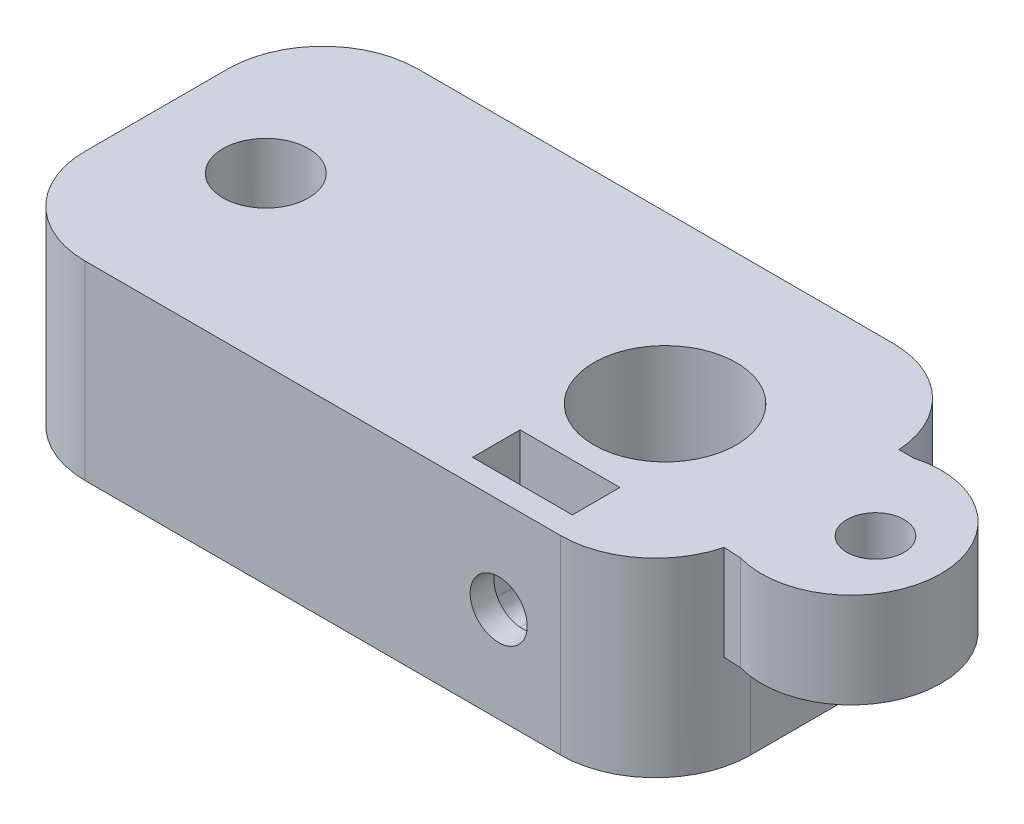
ISO-10303-21;
HEADER;
FILE_DESCRIPTION(('STEP AP214'),'2;1');
FILE_NAME('part.step','',(''),(''),'','','');
FILE_SCHEMA(('AUTOMOTIVE_DESIGN { 1 0 10303 214 1 1 1 1 }'));
ENDSEC;
DATA;
#1=APPLICATION_CONTEXT('core data for automotive mechanical design processes');
#2=APPLICATION_PROTOCOL_DEFINITION('international standard','automotive_design',2000,#1);
#3=PRODUCT_CONTEXT('',#1,'mechanical');
#4=PRODUCT('Part','Part','',(#3));
#5=PRODUCT_RELATED_PRODUCT_CATEGORY('part','',(#4));
#6=PRODUCT_DEFINITION_FORMATION('','',#4);
#7=PRODUCT_DEFINITION_CONTEXT('part definition',#1,'design');
#8=PRODUCT_DEFINITION('design','',#6,#7);
#9=PRODUCT_DEFINITION_SHAPE('','',#8);
#10=(LENGTH_UNIT() NAMED_UNIT(*) SI_UNIT(.MILLI.,.METRE.));
#11=(NAMED_UNIT(*) PLANE_ANGLE_UNIT() SI_UNIT($,.RADIAN.));
#12=(NAMED_UNIT(*) SI_UNIT($,.STERADIAN.) SOLID_ANGLE_UNIT());
#13=UNCERTAINTY_MEASURE_WITH_UNIT(LENGTH_MEASURE(1.E-05),#10,'distance_accuracy_value','');
#14=(GEOMETRIC_REPRESENTATION_CONTEXT(3) GLOBAL_UNCERTAINTY_ASSIGNED_CONTEXT((#13)) GLOBAL_UNIT_ASSIGNED_CONTEXT((#10,
#11,#12)) REPRESENTATION_CONTEXT('',''));
#15=CARTESIAN_POINT('',(0.,0.,0.));
#16=DIRECTION('',(0.,0.,1.));
#17=DIRECTION('',(1.,0.,0.));
#18=AXIS2_PLACEMENT_3D('',#15,#16,#17);
#19=CARTESIAN_POINT('',(-29.3853372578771,20.,-30.4999999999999));
#20=DIRECTION('',(-1.,0.,0.));
#21=DIRECTION('',(0.,0.,1.));
#22=AXIS2_PLACEMENT_3D('',#19,#20,#21);
#23=PLANE('',#22);
#24=DIRECTION('',(0.,0.,1.));
#25=VECTOR('',#24,1.);
#26=CARTESIAN_POINT('',(-29.3853372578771,10.,-40.4999999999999));
#27=LINE('',#26,#25);
#28=CARTESIAN_POINT('',(-29.3853372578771,10.,-55.4999999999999));
#29=VERTEX_POINT('',#28);
#30=CARTESIAN_POINT('',(-29.3853372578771,10.,-40.4999999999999));
#31=VERTEX_POINT('',#30);
#32=EDGE_CURVE('E228',#29,#31,#27,.T.);
#33=ORIENTED_EDGE('',*,*,#32,.T.);
#34=DIRECTION('',(0.,-1.,0.));
#35=VECTOR('',#34,1.);
#36=CARTESIAN_POINT('',(-29.3853372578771,20.,-40.4999999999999));
#37=LINE('',#36,#35);
#38=CARTESIAN_POINT('',(-29.3853372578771,0.,-40.4999999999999));
#39=VERTEX_POINT('',#38);
#40=EDGE_CURVE('E402',#31,#39,#37,.T.);
#41=ORIENTED_EDGE('',*,*,#40,.T.);
#42=DIRECTION('',(0.,0.,-1.));
#43=VECTOR('',#42,1.);
#44=CARTESIAN_POINT('',(-29.3853372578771,0.,-30.4999999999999));
#45=LINE('',#44,#43);
#46=CARTESIAN_POINT('',(-29.3853372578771,0.,-55.4999999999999));
#47=VERTEX_POINT('',#46);
#48=EDGE_CURVE('E432',#39,#47,#45,.T.);
#49=ORIENTED_EDGE('',*,*,#48,.T.);
#50=DIRECTION('',(0.,-1.,0.));
#51=VECTOR('',#50,1.);
#52=CARTESIAN_POINT('',(-29.3853372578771,20.,-55.4999999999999));
#53=LINE('',#52,#51);
#54=EDGE_CURVE('E399',#47,#29,#53,.F.);
#55=ORIENTED_EDGE('',*,*,#54,.T.);
#56=EDGE_LOOP('',(#33,#41,#49,#55));
#57=FACE_BOUND('',#56,.T.);
#58=ADVANCED_FACE('F33',(#57),#23,.F.);
#59=CARTESIAN_POINT('',(-45.8853372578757,10.,-65.5009999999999));
#60=DIRECTION('',(0.,0.,1.));
#61=DIRECTION('',(1.,0.,0.));
#62=AXIS2_PLACEMENT_3D('',#59,#60,#61);
#63=CYLINDRICAL_SURFACE('',#62,3.);
#64=CARTESIAN_POINT('',(-45.8853372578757,10.,-37.9999999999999));
#65=DIRECTION('',(0.,0.,-1.));
#66=DIRECTION('',(-1.,0.,0.));
#67=AXIS2_PLACEMENT_3D('',#64,#65,#66);
#68=CIRCLE('',#67,3.);
#69=CARTESIAN_POINT('',(-48.8853372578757,10.,-37.9999999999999));
#70=VERTEX_POINT('',#69);
#71=EDGE_CURVE('E275',#70,#70,#68,.F.);
#72=ORIENTED_EDGE('',*,*,#71,.T.);
#73=EDGE_LOOP('',(#72));
#74=FACE_BOUND('',#73,.T.);
#75=CARTESIAN_POINT('',(-42.8853372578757,10.,-41.1261364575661));
#76=CARTESIAN_POINT('',(-42.8853441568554,10.1606855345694,-41.1261296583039));
#77=CARTESIAN_POINT('',(-42.8983246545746,10.3216394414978,-41.1204234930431));
#78=CARTESIAN_POINT('',(-42.9497365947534,10.6389086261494,-41.0983337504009));
#79=CARTESIAN_POINT('',(-42.9882330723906,10.7952109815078,-41.0819228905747));
#80=CARTESIAN_POINT('',(-43.0889839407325,11.0980777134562,-41.0405938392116));
#81=CARTESIAN_POINT('',(-43.1511488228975,11.2446763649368,-41.0157077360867));
#82=CARTESIAN_POINT('',(-43.2972070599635,11.5253280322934,-40.9602798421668));
#83=CARTESIAN_POINT('',(-43.3810956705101,11.6593837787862,-40.9297392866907));
#84=CARTESIAN_POINT('',(-43.5733542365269,11.9188904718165,-40.8644870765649));
#85=CARTESIAN_POINT('',(-43.6827682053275,12.0435345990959,-40.8296412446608));
#86=CARTESIAN_POINT('',(-43.9207736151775,12.2732935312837,-40.7608131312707));
#87=CARTESIAN_POINT('',(-44.0493717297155,12.3784015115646,-40.7268311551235));
#88=CARTESIAN_POINT('',(-44.3283277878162,12.5701095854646,-40.661948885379));
#89=CARTESIAN_POINT('',(-44.4793438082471,12.6558164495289,-40.6312229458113));
#90=CARTESIAN_POINT('',(-44.7950992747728,12.8002653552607,-40.5779410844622));
#91=CARTESIAN_POINT('',(-44.9598331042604,12.8590183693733,-40.5553818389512));
#92=CARTESIAN_POINT('',(-45.2898876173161,12.9450122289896,-40.5219251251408));
#93=CARTESIAN_POINT('',(-45.4547937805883,12.9736409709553,-40.5105159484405));
#94=CARTESIAN_POINT('',(-45.7874377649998,13.0030427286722,-40.4987953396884));
#95=CARTESIAN_POINT('',(-45.9551745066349,13.0038261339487,-40.4984797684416));
#96=CARTESIAN_POINT('',(-46.2786859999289,12.9782758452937,-40.5086705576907));
#97=CARTESIAN_POINT('',(-46.4346034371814,12.9534628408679,-40.5185700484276));
#98=CARTESIAN_POINT('',(-46.7398469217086,12.8800106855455,-40.5472606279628));
#99=CARTESIAN_POINT('',(-46.8891724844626,12.8313697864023,-40.5660523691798));
#100=CARTESIAN_POINT('',(-47.1796841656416,12.7110452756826,-40.6110476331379));
#101=CARTESIAN_POINT('',(-47.3207136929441,12.6390254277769,-40.6373585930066));
#102=CARTESIAN_POINT('',(-47.5890494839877,12.4743024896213,-40.6947812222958));
#103=CARTESIAN_POINT('',(-47.7163510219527,12.3815923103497,-40.7258945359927));
#104=CARTESIAN_POINT('',(-47.962490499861,12.1710262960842,-40.7921754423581));
#105=CARTESIAN_POINT('',(-48.0802240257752,12.0519191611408,-40.8274751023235));
#106=CARTESIAN_POINT('',(-48.2944983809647,11.795514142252,-40.896575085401));
#107=CARTESIAN_POINT('',(-48.3910322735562,11.6582103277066,-40.9303749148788));
#108=CARTESIAN_POINT('',(-48.5626935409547,11.3643714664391,-40.9935465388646));
#109=CARTESIAN_POINT('',(-48.6371392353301,11.207402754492,-41.0227662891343));
#110=CARTESIAN_POINT('',(-48.7581016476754,10.8816767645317,-41.0716861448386));
#111=CARTESIAN_POINT('',(-48.8046365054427,10.7129272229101,-41.0913924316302));
#112=CARTESIAN_POINT('',(-48.8657696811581,10.3794463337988,-41.1175536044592));
#113=CARTESIAN_POINT('',(-48.8821454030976,10.2150993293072,-41.1247445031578));
#114=CARTESIAN_POINT('',(-48.8876792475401,9.88588418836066,-41.1271575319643));
#115=CARTESIAN_POINT('',(-48.8768456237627,9.72101622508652,-41.1223832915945));
#116=CARTESIAN_POINT('',(-48.8298866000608,9.40531159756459,-41.1021593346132));
#117=CARTESIAN_POINT('',(-48.7952368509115,9.25421059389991,-41.0873331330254));
#118=CARTESIAN_POINT('',(-48.7035435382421,8.96006739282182,-41.0494492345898));
#119=CARTESIAN_POINT('',(-48.6464950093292,8.81702699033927,-41.0263897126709));
#120=CARTESIAN_POINT('',(-48.5090407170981,8.53659646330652,-40.9734932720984));
#121=CARTESIAN_POINT('',(-48.4277815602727,8.3996707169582,-40.9434194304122));
#122=CARTESIAN_POINT('',(-48.2450850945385,8.14077551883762,-40.880244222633));
#123=CARTESIAN_POINT('',(-48.1436395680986,8.01881219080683,-40.8471416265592));
#124=CARTESIAN_POINT('',(-47.9146035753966,7.78393988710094,-40.7786862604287));
#125=CARTESIAN_POINT('',(-47.7856354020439,7.6723651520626,-40.7433478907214));
#126=CARTESIAN_POINT('',(-47.5099627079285,7.47223438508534,-40.6767030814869));
#127=CARTESIAN_POINT('',(-47.3632574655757,7.38367929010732,-40.6453968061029));
#128=CARTESIAN_POINT('',(-47.0557571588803,7.23242856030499,-40.590244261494));
#129=CARTESIAN_POINT('',(-46.8949654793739,7.1697267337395,-40.56639620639));
#130=CARTESIAN_POINT('',(-46.5639276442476,7.07267672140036,-40.5289092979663));
#131=CARTESIAN_POINT('',(-46.393686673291,7.03831314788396,-40.5152649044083));
#132=CARTESIAN_POINT('',(-46.0605620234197,7.00074294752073,-40.500314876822));
#133=CARTESIAN_POINT('',(-45.8979229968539,6.99564980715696,-40.4982622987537));
#134=CARTESIAN_POINT('',(-45.5741865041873,7.0117832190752,-40.5047093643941));
#135=CARTESIAN_POINT('',(-45.4130888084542,7.03300578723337,-40.5132074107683));
#136=CARTESIAN_POINT('',(-45.1020809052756,7.09982018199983,-40.5394272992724));
#137=CARTESIAN_POINT('',(-44.9519790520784,7.14464341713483,-40.5568577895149));
#138=CARTESIAN_POINT('',(-44.6614537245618,7.2565792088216,-40.5990757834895));
#139=CARTESIAN_POINT('',(-44.5210320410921,7.32369587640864,-40.623864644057));
#140=CARTESIAN_POINT('',(-44.247032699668,7.48165479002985,-40.6797285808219));
#141=CARTESIAN_POINT('',(-44.1140316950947,7.5734144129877,-40.7110330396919));
#142=CARTESIAN_POINT('',(-43.8647561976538,7.77668280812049,-40.7761589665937));
#143=CARTESIAN_POINT('',(-43.7484886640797,7.88819975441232,-40.8099814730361));
#144=CARTESIAN_POINT('',(-43.528535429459,8.13597272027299,-40.8789334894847));
#145=CARTESIAN_POINT('',(-43.4260741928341,8.27333286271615,-40.9140142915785));
#146=CARTESIAN_POINT('',(-43.2455658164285,8.56441365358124,-40.9792551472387));
#147=CARTESIAN_POINT('',(-43.1675215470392,8.71813622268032,-41.0094146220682));
#148=CARTESIAN_POINT('',(-43.0443515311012,9.02355427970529,-41.0586162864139));
#149=CARTESIAN_POINT('',(-42.9968992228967,9.17419240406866,-41.0784135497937));
#150=CARTESIAN_POINT('',(-42.9262573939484,9.48173356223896,-41.1083126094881));
#151=CARTESIAN_POINT('',(-42.9030002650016,9.63861786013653,-41.1184414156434));
#152=CARTESIAN_POINT('',(-42.889954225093,9.83016735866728,-41.1241235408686));
#153=CARTESIAN_POINT('',(-42.8882242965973,9.86410222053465,-41.1248770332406));
#154=CARTESIAN_POINT('',(-42.885915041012,9.93202071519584,-41.1258842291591));
#155=CARTESIAN_POINT('',(-42.8853357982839,9.96600435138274,-41.1261378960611));
#156=CARTESIAN_POINT('',(-42.8853372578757,10.,-41.1261364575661));
#157=B_SPLINE_CURVE_WITH_KNOTS('',3,(#75,#76,#77,#78,#79,#80,#81,#82,#83,#84,#85,#86,#87,#88,
#89,#90,#91,#92,#93,#94,#95,#96,#97,#98,#99,#100,#101,#102,#103,#104,#105,#106,#107,#108,#109,
#110,#111,#112,#113,#114,#115,#116,#117,#118,#119,#120,#121,#122,#123,#124,#125,#126,#127,#128,
#129,#130,#131,#132,#133,#134,#135,#136,#137,#138,#139,#140,#141,#142,#143,#144,#145,#146,#147,
#148,#149,#150,#151,#152,#153,#154,#155,#156),.UNSPECIFIED.,.T.,.F.,(4,2,2,2,2,2,2,2,2,2,2,2,2,
2,2,2,2,2,2,2,2,2,2,2,2,2,2,2,2,2,2,2,2,2,2,2,2,2,2,2,4),(0.,0.48191647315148,0.965066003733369,
1.44640623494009,1.92764143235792,2.43383427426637,2.94020361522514,3.46654003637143,
3.99266200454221,4.49331274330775,4.99377667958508,5.46612967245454,5.9385173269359,
6.41802450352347,6.89769622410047,7.40886066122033,7.9201921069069,8.44596688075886,
8.97139957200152,9.4647322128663,9.95791522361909,10.4230087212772,10.8882053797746,
11.3722673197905,11.8565267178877,12.3765560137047,12.8966064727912,13.4165323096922,
13.9361756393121,14.4219155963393,14.907582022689,15.3783299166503,15.8491646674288,
16.3408057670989,16.8326507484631,17.3549437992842,17.8772982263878,18.3527499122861,
18.8268694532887,18.928819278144,19.0307765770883),.UNSPECIFIED.);
#158=CARTESIAN_POINT('',(-42.8853372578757,10.,-41.1261364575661));
#159=VERTEX_POINT('',#158);
#160=EDGE_CURVE('E274',#159,#159,#157,.T.);
#161=ORIENTED_EDGE('',*,*,#160,.F.);
#162=EDGE_LOOP('',(#161));
#163=FACE_BOUND('',#162,.T.);
#164=ADVANCED_FACE('F327',(#74,#163),#63,.F.);
#165=CARTESIAN_POINT('',(-85.3853372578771,0.,0.));
#166=DIRECTION('',(-1.,0.,0.));
#167=DIRECTION('',(0.,0.,1.));
#168=AXIS2_PLACEMENT_3D('',#165,#166,#167);
#169=PLANE('',#168);
#170=DIRECTION('',(0.,1.,0.));
#171=VECTOR('',#170,1.);
#172=CARTESIAN_POINT('',(-85.3853372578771,-7.,-44.258342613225));
#173=LINE('',#172,#171);
#174=CARTESIAN_POINT('',(-85.3853372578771,7.,-44.258342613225));
#175=VERTEX_POINT('',#174);
#176=CARTESIAN_POINT('',(-85.3853372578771,13.,-44.258342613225));
#177=VERTEX_POINT('',#176);
#178=EDGE_CURVE('E417',#175,#177,#173,.T.);
#179=ORIENTED_EDGE('',*,*,#178,.F.);
#180=DIRECTION('',(0.,0.,1.));
#181=VECTOR('',#180,1.);
#182=CARTESIAN_POINT('',(-85.3853372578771,7.,-54.4999999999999));
#183=LINE('',#182,#181);
#184=CARTESIAN_POINT('',(-85.3853372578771,7.,-41.4999999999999));
#185=VERTEX_POINT('',#184);
#186=EDGE_CURVE('E480',#175,#185,#183,.T.);
#187=ORIENTED_EDGE('',*,*,#186,.T.);
#188=DIRECTION('',(0.,1.,0.));
#189=VECTOR('',#188,1.);
#190=CARTESIAN_POINT('',(-85.3853372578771,13.,-41.4999999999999));
#191=LINE('',#190,#189);
#192=CARTESIAN_POINT('',(-85.3853372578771,13.,-41.4999999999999));
#193=VERTEX_POINT('',#192);
#194=EDGE_CURVE('E474',#185,#193,#191,.T.);
#195=ORIENTED_EDGE('',*,*,#194,.T.);
#196=DIRECTION('',(0.,0.,-1.));
#197=VECTOR('',#196,1.);
#198=CARTESIAN_POINT('',(-85.3853372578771,13.,-54.4999999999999));
#199=LINE('',#198,#197);
#200=EDGE_CURVE('E453',#193,#177,#199,.T.);
#201=ORIENTED_EDGE('',*,*,#200,.T.);
#202=EDGE_LOOP('',(#179,#187,#195,#201));
#203=FACE_BOUND('',#202,.T.);
#204=ADVANCED_FACE('F333',(#203),#169,.T.);
#205=CARTESIAN_POINT('',(0.,20.,0.));
#206=DIRECTION('',(0.,1.,0.));
#207=DIRECTION('',(0.,0.,1.));
#208=AXIS2_PLACEMENT_3D('',#205,#206,#207);
#209=PLANE('',#208);
#210=DIRECTION('',(-1.,0.,0.));
#211=VECTOR('',#210,1.);
#212=CARTESIAN_POINT('',(-27.8853372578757,20.,-56.1240146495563));
#213=LINE('',#212,#211);
#214=CARTESIAN_POINT('',(-27.8853372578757,20.,-56.1240146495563));
#215=VERTEX_POINT('',#214);
#216=CARTESIAN_POINT('',(-29.4048259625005,20.,-56.1240146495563));
#217=VERTEX_POINT('',#216);
#218=EDGE_CURVE('E200',#215,#217,#213,.T.);
#219=ORIENTED_EDGE('',*,*,#218,.T.);
#220=CARTESIAN_POINT('',(-39.3853372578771,20.,-55.4999999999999));
#221=DIRECTION('',(0.,1.,0.));
#222=DIRECTION('',(0.,0.,1.));
#223=AXIS2_PLACEMENT_3D('',#220,#221,#222);
#224=CIRCLE('',#223,10.);
#225=CARTESIAN_POINT('',(-39.3853372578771,20.,-65.4999999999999));
#226=VERTEX_POINT('',#225);
#227=EDGE_CURVE('E390',#217,#226,#224,.T.);
#228=ORIENTED_EDGE('',*,*,#227,.T.);
#229=DIRECTION('',(-1.,0.,0.));
#230=VECTOR('',#229,1.);
#231=CARTESIAN_POINT('',(-29.3853372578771,20.,-65.4999999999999));
#232=LINE('',#231,#230);
#233=CARTESIAN_POINT('',(-89.3853372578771,20.,-65.4999999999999));
#234=VERTEX_POINT('',#233);
#235=EDGE_CURVE('E425',#226,#234,#232,.T.);
#236=ORIENTED_EDGE('',*,*,#235,.T.);
#237=CARTESIAN_POINT('',(-89.3853372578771,20.,-55.4999999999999));
#238=DIRECTION('',(0.,1.,0.));
#239=DIRECTION('',(0.,0.,1.));
#240=AXIS2_PLACEMENT_3D('',#237,#238,#239);
#241=CIRCLE('',#240,10.);
#242=CARTESIAN_POINT('',(-99.3853372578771,20.,-55.4999999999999));
#243=VERTEX_POINT('',#242);
#244=EDGE_CURVE('E395',#234,#243,#241,.T.);
#245=ORIENTED_EDGE('',*,*,#244,.T.);
#246=DIRECTION('',(0.,0.,1.));
#247=VECTOR('',#246,1.);
#248=CARTESIAN_POINT('',(-99.3853372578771,20.,-30.4999999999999));
#249=LINE('',#248,#247);
#250=CARTESIAN_POINT('',(-99.3853372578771,20.,-40.4999999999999));
#251=VERTEX_POINT('',#250);
#252=EDGE_CURVE('E438',#243,#251,#249,.T.);
#253=ORIENTED_EDGE('',*,*,#252,.T.);
#254=CARTESIAN_POINT('',(-89.3853372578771,20.,-40.4999999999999));
#255=DIRECTION('',(0.,1.,0.));
#256=DIRECTION('',(0.,0.,1.));
#257=AXIS2_PLACEMENT_3D('',#254,#255,#256);
#258=CIRCLE('',#257,10.);
#259=CARTESIAN_POINT('',(-89.3853372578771,20.,-30.4999999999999));
#260=VERTEX_POINT('',#259);
#261=EDGE_CURVE('E397',#251,#260,#258,.T.);
#262=ORIENTED_EDGE('',*,*,#261,.T.);
#263=DIRECTION('',(1.,0.,0.));
#264=VECTOR('',#263,1.);
#265=CARTESIAN_POINT('',(-29.3853372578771,20.,-30.4999999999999));
#266=LINE('',#265,#264);
#267=CARTESIAN_POINT('',(-39.3853372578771,20.,-30.4999999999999));
#268=VERTEX_POINT('',#267);
#269=EDGE_CURVE('E421',#260,#268,#266,.T.);
#270=ORIENTED_EDGE('',*,*,#269,.T.);
#271=CARTESIAN_POINT('',(-39.3853372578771,20.,-40.4999999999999));
#272=DIRECTION('',(0.,1.,0.));
#273=DIRECTION('',(0.,0.,1.));
#274=AXIS2_PLACEMENT_3D('',#271,#272,#273);
#275=CIRCLE('',#274,10.);
#276=CARTESIAN_POINT('',(-29.6975702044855,20.,-38.0206513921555));
#277=VERTEX_POINT('',#276);
#278=EDGE_CURVE('E392',#268,#277,#275,.T.);
#279=ORIENTED_EDGE('',*,*,#278,.T.);
#280=DIRECTION('',(0.998650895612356,0.,0.0519267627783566));
#281=VECTOR('',#280,1.);
#282=CARTESIAN_POINT('',(-27.8853372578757,20.,-37.9264208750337));
#283=LINE('',#282,#281);
#284=CARTESIAN_POINT('',(-27.8853372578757,20.,-37.9264208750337));
#285=VERTEX_POINT('',#284);
#286=EDGE_CURVE('E219',#277,#285,#283,.T.);
#287=ORIENTED_EDGE('',*,*,#286,.T.);
#288=CARTESIAN_POINT('',(-25.3386570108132,20.,-47.025217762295));
#289=DIRECTION('',(0.,1.,0.));
#290=DIRECTION('',(0.,0.,1.));
#291=AXIS2_PLACEMENT_3D('',#288,#289,#290);
#292=CIRCLE('',#291,9.44847527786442);
#293=EDGE_CURVE('E235',#285,#215,#292,.T.);
#294=ORIENTED_EDGE('',*,*,#293,.T.);
#295=EDGE_LOOP('',(#219,#228,#236,#245,#253,#262,#270,#279,#287,#294));
#296=FACE_BOUND('',#295,.T.);
#297=DIRECTION('',(0.,0.,1.));
#298=VECTOR('',#297,1.);
#299=CARTESIAN_POINT('',(-51.1353372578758,20.,-37.9999999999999));
#300=LINE('',#299,#298);
#301=CARTESIAN_POINT('',(-51.1353372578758,20.,-37.9999999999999));
#302=VERTEX_POINT('',#301);
#303=CARTESIAN_POINT('',(-51.1353372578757,20.,-32.9999999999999));
#304=VERTEX_POINT('',#303);
#305=EDGE_CURVE('E240',#302,#304,#300,.T.);
#306=ORIENTED_EDGE('',*,*,#305,.F.);
#307=DIRECTION('',(-1.,0.,0.));
#308=VECTOR('',#307,1.);
#309=CARTESIAN_POINT('',(-51.1353372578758,20.,-37.9999999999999));
#310=LINE('',#309,#308);
#311=CARTESIAN_POINT('',(-40.6353372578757,20.,-37.9999999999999));
#312=VERTEX_POINT('',#311);
#313=EDGE_CURVE('E249',#312,#302,#310,.T.);
#314=ORIENTED_EDGE('',*,*,#313,.F.);
#315=DIRECTION('',(0.,0.,-1.));
#316=VECTOR('',#315,1.);
#317=CARTESIAN_POINT('',(-40.6353372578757,20.,-37.9999999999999));
#318=LINE('',#317,#316);
#319=CARTESIAN_POINT('',(-40.6353372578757,20.,-32.9999999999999));
#320=VERTEX_POINT('',#319);
#321=EDGE_CURVE('E258',#320,#312,#318,.T.);
#322=ORIENTED_EDGE('',*,*,#321,.F.);
#323=DIRECTION('',(1.,0.,0.));
#324=VECTOR('',#323,1.);
#325=CARTESIAN_POINT('',(-51.1353372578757,20.,-32.9999999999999));
#326=LINE('',#325,#324);
#327=EDGE_CURVE('E255',#304,#320,#326,.T.);
#328=ORIENTED_EDGE('',*,*,#327,.F.);
#329=EDGE_LOOP('',(#306,#314,#322,#328));
#330=FACE_BOUND('',#329,.T.);
#331=CARTESIAN_POINT('',(-87.8853372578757,20.,-47.9999999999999));
#332=DIRECTION('',(0.,1.,0.));
#333=DIRECTION('',(0.,0.,1.));
#334=AXIS2_PLACEMENT_3D('',#331,#332,#333);
#335=CIRCLE('',#334,4.50000000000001);
#336=CARTESIAN_POINT('',(-87.8853372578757,20.,-43.4999999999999));
#337=VERTEX_POINT('',#336);
#338=EDGE_CURVE('E282',#337,#337,#335,.T.);
#339=ORIENTED_EDGE('',*,*,#338,.F.);
#340=EDGE_LOOP('',(#339));
#341=FACE_BOUND('',#340,.T.);
#342=CARTESIAN_POINT('',(-45.8853372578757,20.,-47.9999999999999));
#343=DIRECTION('',(0.,1.,0.));
#344=DIRECTION('',(0.,0.,1.));
#345=AXIS2_PLACEMENT_3D('',#342,#343,#344);
#346=CIRCLE('',#345,7.50000000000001);
#347=CARTESIAN_POINT('',(-45.8853372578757,20.,-40.4999999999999));
#348=VERTEX_POINT('',#347);
#349=EDGE_CURVE('E435',#348,#348,#346,.T.);
#350=ORIENTED_EDGE('',*,*,#349,.F.);
#351=EDGE_LOOP('',(#350));
#352=FACE_BOUND('',#351,.T.);
#353=CARTESIAN_POINT('',(-22.7756224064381,20.,-47.025217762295));
#354=DIRECTION('',(0.,1.,0.));
#355=DIRECTION('',(0.,0.,1.));
#356=AXIS2_PLACEMENT_3D('',#353,#354,#355);
#357=CIRCLE('',#356,2.99999999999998);
#358=CARTESIAN_POINT('',(-22.7756224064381,20.,-44.025217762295));
#359=VERTEX_POINT('',#358);
#360=EDGE_CURVE('E224',#359,#359,#357,.T.);
#361=ORIENTED_EDGE('',*,*,#360,.F.);
#362=EDGE_LOOP('',(#361));
#363=FACE_BOUND('',#362,.T.);
#364=ADVANCED_FACE('F497',(#296,#330,#341,#352,#363),#209,.T.);
#365=CARTESIAN_POINT('',(0.,0.,0.));
#366=DIRECTION('',(0.,1.,0.));
#367=DIRECTION('',(0.,0.,1.));
#368=AXIS2_PLACEMENT_3D('',#365,#366,#367);
#369=PLANE('',#368);
#370=CARTESIAN_POINT('',(-87.8853372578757,0.,-47.9999999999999));
#371=DIRECTION('',(0.,1.,0.));
#372=DIRECTION('',(0.,0.,1.));
#373=AXIS2_PLACEMENT_3D('',#370,#371,#372);
#374=CIRCLE('',#373,4.50000000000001);
#375=CARTESIAN_POINT('',(-87.8853372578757,0.,-43.4999999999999));
#376=VERTEX_POINT('',#375);
#377=EDGE_CURVE('E470',#376,#376,#374,.T.);
#378=ORIENTED_EDGE('',*,*,#377,.T.);
#379=EDGE_LOOP('',(#378));
#380=FACE_BOUND('',#379,.T.);
#381=DIRECTION('',(-1.,0.,0.));
#382=VECTOR('',#381,1.);
#383=CARTESIAN_POINT('',(-29.3853372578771,0.,-65.4999999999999));
#384=LINE('',#383,#382);
#385=CARTESIAN_POINT('',(-39.3853372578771,0.,-65.4999999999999));
#386=VERTEX_POINT('',#385);
#387=CARTESIAN_POINT('',(-89.3853372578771,0.,-65.4999999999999));
#388=VERTEX_POINT('',#387);
#389=EDGE_CURVE('E429',#386,#388,#384,.T.);
#390=ORIENTED_EDGE('',*,*,#389,.F.);
#391=CARTESIAN_POINT('',(-39.3853372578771,0.,-55.4999999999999));
#392=DIRECTION('',(0.,1.,0.));
#393=DIRECTION('',(0.,0.,1.));
#394=AXIS2_PLACEMENT_3D('',#391,#392,#393);
#395=CIRCLE('',#394,10.);
#396=EDGE_CURVE('E404',#386,#47,#395,.F.);
#397=ORIENTED_EDGE('',*,*,#396,.T.);
#398=ORIENTED_EDGE('',*,*,#48,.F.);
#399=CARTESIAN_POINT('',(-39.3853372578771,0.,-40.4999999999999));
#400=DIRECTION('',(0.,1.,0.));
#401=DIRECTION('',(0.,0.,1.));
#402=AXIS2_PLACEMENT_3D('',#399,#400,#401);
#403=CIRCLE('',#402,10.);
#404=CARTESIAN_POINT('',(-39.3853372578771,0.,-30.4999999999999));
#405=VERTEX_POINT('',#404);
#406=EDGE_CURVE('E406',#39,#405,#403,.F.);
#407=ORIENTED_EDGE('',*,*,#406,.T.);
#408=DIRECTION('',(1.,0.,0.));
#409=VECTOR('',#408,1.);
#410=CARTESIAN_POINT('',(-29.3853372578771,0.,-30.4999999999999));
#411=LINE('',#410,#409);
#412=CARTESIAN_POINT('',(-89.3853372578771,0.,-30.4999999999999));
#413=VERTEX_POINT('',#412);
#414=EDGE_CURVE('E422',#413,#405,#411,.T.);
#415=ORIENTED_EDGE('',*,*,#414,.F.);
#416=CARTESIAN_POINT('',(-89.3853372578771,0.,-40.4999999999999));
#417=DIRECTION('',(0.,1.,0.));
#418=DIRECTION('',(0.,0.,1.));
#419=AXIS2_PLACEMENT_3D('',#416,#417,#418);
#420=CIRCLE('',#419,10.);
#421=CARTESIAN_POINT('',(-99.3853372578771,0.,-40.4999999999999));
#422=VERTEX_POINT('',#421);
#423=EDGE_CURVE('E410',#413,#422,#420,.F.);
#424=ORIENTED_EDGE('',*,*,#423,.T.);
#425=DIRECTION('',(0.,0.,1.));
#426=VECTOR('',#425,1.);
#427=CARTESIAN_POINT('',(-99.3853372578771,0.,-30.4999999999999));
#428=LINE('',#427,#426);
#429=CARTESIAN_POINT('',(-99.3853372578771,0.,-55.4999999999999));
#430=VERTEX_POINT('',#429);
#431=EDGE_CURVE('E426',#430,#422,#428,.T.);
#432=ORIENTED_EDGE('',*,*,#431,.F.);
#433=CARTESIAN_POINT('',(-89.3853372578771,0.,-55.4999999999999));
#434=DIRECTION('',(0.,1.,0.));
#435=DIRECTION('',(0.,0.,1.));
#436=AXIS2_PLACEMENT_3D('',#433,#434,#435);
#437=CIRCLE('',#436,10.);
#438=EDGE_CURVE('E408',#430,#388,#437,.F.);
#439=ORIENTED_EDGE('',*,*,#438,.T.);
#440=EDGE_LOOP('',(#390,#397,#398,#407,#415,#424,#432,#439));
#441=FACE_BOUND('',#440,.T.);
#442=CARTESIAN_POINT('',(-45.8853372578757,0.,-47.9999999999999));
#443=DIRECTION('',(0.,1.,0.));
#444=DIRECTION('',(0.,0.,1.));
#445=AXIS2_PLACEMENT_3D('',#442,#443,#444);
#446=CIRCLE('',#445,7.50000000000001);
#447=CARTESIAN_POINT('',(-45.8853372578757,0.,-40.4999999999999));
#448=VERTEX_POINT('',#447);
#449=EDGE_CURVE('E443',#448,#448,#446,.T.);
#450=ORIENTED_EDGE('',*,*,#449,.T.);
#451=EDGE_LOOP('',(#450));
#452=FACE_BOUND('',#451,.T.);
#453=ADVANCED_FACE('F500',(#380,#441,#452),#369,.F.);
#454=CARTESIAN_POINT('',(-29.3853372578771,20.,-65.4999999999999));
#455=DIRECTION('',(0.,0.,1.));
#456=DIRECTION('',(1.,0.,0.));
#457=AXIS2_PLACEMENT_3D('',#454,#455,#456);
#458=PLANE('',#457);
#459=ORIENTED_EDGE('',*,*,#235,.F.);
#460=DIRECTION('',(0.,-1.,0.));
#461=VECTOR('',#460,1.);
#462=CARTESIAN_POINT('',(-39.3853372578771,20.,-65.4999999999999));
#463=LINE('',#462,#461);
#464=EDGE_CURVE('E412',#226,#386,#463,.T.);
#465=ORIENTED_EDGE('',*,*,#464,.T.);
#466=ORIENTED_EDGE('',*,*,#389,.T.);
#467=DIRECTION('',(0.,-1.,0.));
#468=VECTOR('',#467,1.);
#469=CARTESIAN_POINT('',(-89.3853372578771,20.,-65.4999999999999));
#470=LINE('',#469,#468);
#471=EDGE_CURVE('E415',#388,#234,#470,.F.);
#472=ORIENTED_EDGE('',*,*,#471,.T.);
#473=EDGE_LOOP('',(#459,#465,#466,#472));
#474=FACE_BOUND('',#473,.T.);
#475=ADVANCED_FACE('F337',(#474),#458,.F.);
#476=CARTESIAN_POINT('',(-99.3853372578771,20.,-30.4999999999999));
#477=DIRECTION('',(1.,0.,0.));
#478=DIRECTION('',(0.,0.,-1.));
#479=AXIS2_PLACEMENT_3D('',#476,#477,#478);
#480=PLANE('',#479);
#481=DIRECTION('',(0.,0.,1.));
#482=VECTOR('',#481,1.);
#483=CARTESIAN_POINT('',(-99.3853372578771,7.,-54.4999999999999));
#484=LINE('',#483,#482);
#485=CARTESIAN_POINT('',(-99.3853372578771,7.,-54.4999999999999));
#486=VERTEX_POINT('',#485);
#487=CARTESIAN_POINT('',(-99.3853372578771,7.,-41.4999999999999));
#488=VERTEX_POINT('',#487);
#489=EDGE_CURVE('E465',#486,#488,#484,.T.);
#490=ORIENTED_EDGE('',*,*,#489,.F.);
#491=DIRECTION('',(0.,-1.,0.));
#492=VECTOR('',#491,1.);
#493=CARTESIAN_POINT('',(-99.3853372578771,13.,-54.4999999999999));
#494=LINE('',#493,#492);
#495=CARTESIAN_POINT('',(-99.3853372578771,13.,-54.4999999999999));
#496=VERTEX_POINT('',#495);
#497=EDGE_CURVE('E468',#496,#486,#494,.T.);
#498=ORIENTED_EDGE('',*,*,#497,.F.);
#499=DIRECTION('',(0.,0.,-1.));
#500=VECTOR('',#499,1.);
#501=CARTESIAN_POINT('',(-99.3853372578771,13.,-54.4999999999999));
#502=LINE('',#501,#500);
#503=CARTESIAN_POINT('',(-99.3853372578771,13.,-41.4999999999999));
#504=VERTEX_POINT('',#503);
#505=EDGE_CURVE('E458',#504,#496,#502,.T.);
#506=ORIENTED_EDGE('',*,*,#505,.F.);
#507=DIRECTION('',(0.,1.,0.));
#508=VECTOR('',#507,1.);
#509=CARTESIAN_POINT('',(-99.3853372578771,13.,-41.4999999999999));
#510=LINE('',#509,#508);
#511=EDGE_CURVE('E462',#488,#504,#510,.T.);
#512=ORIENTED_EDGE('',*,*,#511,.F.);
#513=EDGE_LOOP('',(#490,#498,#506,#512));
#514=FACE_BOUND('',#513,.T.);
#515=ORIENTED_EDGE('',*,*,#252,.F.);
#516=DIRECTION('',(0.,-1.,0.));
#517=VECTOR('',#516,1.);
#518=CARTESIAN_POINT('',(-99.3853372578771,20.,-55.4999999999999));
#519=LINE('',#518,#517);
#520=EDGE_CURVE('E376',#243,#430,#519,.T.);
#521=ORIENTED_EDGE('',*,*,#520,.T.);
#522=ORIENTED_EDGE('',*,*,#431,.T.);
#523=DIRECTION('',(0.,-1.,0.));
#524=VECTOR('',#523,1.);
#525=CARTESIAN_POINT('',(-99.3853372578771,20.,-40.4999999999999));
#526=LINE('',#525,#524);
#527=EDGE_CURVE('E383',#422,#251,#526,.F.);
#528=ORIENTED_EDGE('',*,*,#527,.T.);
#529=EDGE_LOOP('',(#515,#521,#522,#528));
#530=FACE_BOUND('',#529,.T.);
#531=ADVANCED_FACE('F524',(#514,#530),#480,.F.);
#532=CARTESIAN_POINT('',(-29.3853372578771,20.,-30.4999999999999));
#533=DIRECTION('',(0.,0.,-1.));
#534=DIRECTION('',(-1.,0.,0.));
#535=AXIS2_PLACEMENT_3D('',#532,#533,#534);
#536=PLANE('',#535);
#537=CARTESIAN_POINT('',(-45.8853372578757,10.,-30.4999999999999));
#538=DIRECTION('',(0.,0.,1.));
#539=DIRECTION('',(1.,0.,0.));
#540=AXIS2_PLACEMENT_3D('',#537,#538,#539);
#541=CIRCLE('',#540,3.);
#542=CARTESIAN_POINT('',(-42.8853372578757,10.,-30.4999999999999));
#543=VERTEX_POINT('',#542);
#544=EDGE_CURVE('E271',#543,#543,#541,.T.);
#545=ORIENTED_EDGE('',*,*,#544,.F.);
#546=EDGE_LOOP('',(#545));
#547=FACE_BOUND('',#546,.T.);
#548=ORIENTED_EDGE('',*,*,#414,.T.);
#549=DIRECTION('',(0.,-1.,0.));
#550=VECTOR('',#549,1.);
#551=CARTESIAN_POINT('',(-39.3853372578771,20.,-30.4999999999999));
#552=LINE('',#551,#550);
#553=EDGE_CURVE('E385',#405,#268,#552,.F.);
#554=ORIENTED_EDGE('',*,*,#553,.T.);
#555=ORIENTED_EDGE('',*,*,#269,.F.);
#556=DIRECTION('',(0.,-1.,0.));
#557=VECTOR('',#556,1.);
#558=CARTESIAN_POINT('',(-89.3853372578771,20.,-30.4999999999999));
#559=LINE('',#558,#557);
#560=EDGE_CURVE('E387',#260,#413,#559,.T.);
#561=ORIENTED_EDGE('',*,*,#560,.T.);
#562=EDGE_LOOP('',(#548,#554,#555,#561));
#563=FACE_BOUND('',#562,.T.);
#564=ADVANCED_FACE('F513',(#547,#563),#536,.F.);
#565=CARTESIAN_POINT('',(-45.8853372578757,20.,-47.9999999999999));
#566=DIRECTION('',(0.,-1.,0.));
#567=DIRECTION('',(0.,0.,-1.));
#568=AXIS2_PLACEMENT_3D('',#565,#566,#567);
#569=CYLINDRICAL_SURFACE('',#568,7.50000000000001);
#570=ORIENTED_EDGE('',*,*,#160,.T.);
#571=EDGE_LOOP('',(#570));
#572=FACE_BOUND('',#571,.T.);
#573=ORIENTED_EDGE('',*,*,#349,.T.);
#574=EDGE_LOOP('',(#573));
#575=FACE_BOUND('',#574,.T.);
#576=ORIENTED_EDGE('',*,*,#449,.F.);
#577=EDGE_LOOP('',(#576));
#578=FACE_BOUND('',#577,.T.);
#579=ADVANCED_FACE('F509',(#572,#575,#578),#569,.F.);
#580=CARTESIAN_POINT('',(-85.3853372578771,13.,-54.4999999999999));
#581=DIRECTION('',(0.,0.,-1.));
#582=DIRECTION('',(-1.,0.,0.));
#583=AXIS2_PLACEMENT_3D('',#580,#581,#582);
#584=PLANE('',#583);
#585=ORIENTED_EDGE('',*,*,#497,.T.);
#586=DIRECTION('',(-1.,0.,0.));
#587=VECTOR('',#586,1.);
#588=CARTESIAN_POINT('',(-85.3853372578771,7.,-54.4999999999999));
#589=LINE('',#588,#587);
#590=CARTESIAN_POINT('',(-85.3853372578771,7.,-54.4999999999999));
#591=VERTEX_POINT('',#590);
#592=EDGE_CURVE('E449',#591,#486,#589,.T.);
#593=ORIENTED_EDGE('',*,*,#592,.F.);
#594=DIRECTION('',(0.,-1.,0.));
#595=VECTOR('',#594,1.);
#596=CARTESIAN_POINT('',(-85.3853372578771,13.,-54.4999999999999));
#597=LINE('',#596,#595);
#598=CARTESIAN_POINT('',(-85.3853372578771,13.,-54.4999999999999));
#599=VERTEX_POINT('',#598);
#600=EDGE_CURVE('E461',#599,#591,#597,.T.);
#601=ORIENTED_EDGE('',*,*,#600,.F.);
#602=DIRECTION('',(-1.,0.,0.));
#603=VECTOR('',#602,1.);
#604=CARTESIAN_POINT('',(-85.3853372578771,13.,-54.4999999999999));
#605=LINE('',#604,#603);
#606=EDGE_CURVE('E446',#599,#496,#605,.T.);
#607=ORIENTED_EDGE('',*,*,#606,.T.);
#608=EDGE_LOOP('',(#585,#593,#601,#607));
#609=FACE_BOUND('',#608,.T.);
#610=ADVANCED_FACE('F512',(#609),#584,.F.);
#611=CARTESIAN_POINT('',(-85.3853372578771,13.,-54.4999999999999));
#612=DIRECTION('',(0.,1.,0.));
#613=DIRECTION('',(0.,0.,1.));
#614=AXIS2_PLACEMENT_3D('',#611,#612,#613);
#615=PLANE('',#614);
#616=CARTESIAN_POINT('',(-85.3853372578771,13.,-51.7416573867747));
#617=VERTEX_POINT('',#616);
#618=EDGE_CURVE('E473',#617,#599,#199,.T.);
#619=ORIENTED_EDGE('',*,*,#618,.F.);
#620=CARTESIAN_POINT('',(-87.8853372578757,13.,-47.9999999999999));
#621=DIRECTION('',(0.,1.,0.));
#622=DIRECTION('',(0.,0.,1.));
#623=AXIS2_PLACEMENT_3D('',#620,#621,#622);
#624=CIRCLE('',#623,4.50000000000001);
#625=EDGE_CURVE('E485',#617,#177,#624,.T.);
#626=ORIENTED_EDGE('',*,*,#625,.T.);
#627=ORIENTED_EDGE('',*,*,#200,.F.);
#628=DIRECTION('',(-1.,0.,0.));
#629=VECTOR('',#628,1.);
#630=CARTESIAN_POINT('',(-85.3853372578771,13.,-41.4999999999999));
#631=LINE('',#630,#629);
#632=EDGE_CURVE('E455',#193,#504,#631,.T.);
#633=ORIENTED_EDGE('',*,*,#632,.T.);
#634=ORIENTED_EDGE('',*,*,#505,.T.);
#635=ORIENTED_EDGE('',*,*,#606,.F.);
#636=EDGE_LOOP('',(#619,#626,#627,#633,#634,#635));
#637=FACE_BOUND('',#636,.T.);
#638=ADVANCED_FACE('F717',(#637),#615,.F.);
#639=CARTESIAN_POINT('',(-85.3853372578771,13.,-41.4999999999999));
#640=DIRECTION('',(0.,0.,1.));
#641=DIRECTION('',(1.,0.,0.));
#642=AXIS2_PLACEMENT_3D('',#639,#640,#641);
#643=PLANE('',#642);
#644=ORIENTED_EDGE('',*,*,#511,.T.);
#645=ORIENTED_EDGE('',*,*,#632,.F.);
#646=ORIENTED_EDGE('',*,*,#194,.F.);
#647=DIRECTION('',(-1.,0.,0.));
#648=VECTOR('',#647,1.);
#649=CARTESIAN_POINT('',(-85.3853372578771,7.,-41.4999999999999));
#650=LINE('',#649,#648);
#651=EDGE_CURVE('E452',#185,#488,#650,.T.);
#652=ORIENTED_EDGE('',*,*,#651,.T.);
#653=EDGE_LOOP('',(#644,#645,#646,#652));
#654=FACE_BOUND('',#653,.T.);
#655=ADVANCED_FACE('F712',(#654),#643,.F.);
#656=CARTESIAN_POINT('',(-85.3853372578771,7.,-54.4999999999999));
#657=DIRECTION('',(0.,-1.,0.));
#658=DIRECTION('',(0.,0.,-1.));
#659=AXIS2_PLACEMENT_3D('',#656,#657,#658);
#660=PLANE('',#659);
#661=ORIENTED_EDGE('',*,*,#186,.F.);
#662=CARTESIAN_POINT('',(-87.8853372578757,7.,-47.9999999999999));
#663=DIRECTION('',(0.,-1.,0.));
#664=DIRECTION('',(0.,0.,-1.));
#665=AXIS2_PLACEMENT_3D('',#662,#663,#664);
#666=CIRCLE('',#665,4.50000000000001);
#667=CARTESIAN_POINT('',(-85.3853372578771,7.,-51.7416573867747));
#668=VERTEX_POINT('',#667);
#669=EDGE_CURVE('E487',#175,#668,#666,.T.);
#670=ORIENTED_EDGE('',*,*,#669,.T.);
#671=EDGE_CURVE('E477',#591,#668,#183,.T.);
#672=ORIENTED_EDGE('',*,*,#671,.F.);
#673=ORIENTED_EDGE('',*,*,#592,.T.);
#674=ORIENTED_EDGE('',*,*,#489,.T.);
#675=ORIENTED_EDGE('',*,*,#651,.F.);
#676=EDGE_LOOP('',(#661,#670,#672,#673,#674,#675));
#677=FACE_BOUND('',#676,.T.);
#678=ADVANCED_FACE('F727',(#677),#660,.F.);
#679=DIRECTION('',(0.,1.,0.));
#680=VECTOR('',#679,1.);
#681=CARTESIAN_POINT('',(-85.3853372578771,-7.,-51.7416573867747));
#682=LINE('',#681,#680);
#683=EDGE_CURVE('E419',#617,#668,#682,.F.);
#684=ORIENTED_EDGE('',*,*,#683,.F.);
#685=ORIENTED_EDGE('',*,*,#618,.T.);
#686=ORIENTED_EDGE('',*,*,#600,.T.);
#687=ORIENTED_EDGE('',*,*,#671,.T.);
#688=EDGE_LOOP('',(#684,#685,#686,#687));
#689=FACE_BOUND('',#688,.T.);
#690=ADVANCED_FACE('F704',(#689),#169,.T.);
#691=CARTESIAN_POINT('',(-87.8853372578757,-7.,-47.9999999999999));
#692=DIRECTION('',(0.,1.,0.));
#693=DIRECTION('',(0.,0.,1.));
#694=AXIS2_PLACEMENT_3D('',#691,#692,#693);
#695=CYLINDRICAL_SURFACE('',#694,4.50000000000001);
#696=ORIENTED_EDGE('',*,*,#338,.T.);
#697=EDGE_LOOP('',(#696));
#698=FACE_BOUND('',#697,.T.);
#699=ORIENTED_EDGE('',*,*,#178,.T.);
#700=ORIENTED_EDGE('',*,*,#625,.F.);
#701=ORIENTED_EDGE('',*,*,#683,.T.);
#702=ORIENTED_EDGE('',*,*,#669,.F.);
#703=EDGE_LOOP('',(#699,#700,#701,#702));
#704=FACE_BOUND('',#703,.T.);
#705=ORIENTED_EDGE('',*,*,#377,.F.);
#706=EDGE_LOOP('',(#705));
#707=FACE_BOUND('',#706,.T.);
#708=ADVANCED_FACE('F343',(#698,#704,#707),#695,.F.);
#709=CARTESIAN_POINT('',(-39.3853372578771,20.,-55.4999999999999));
#710=DIRECTION('',(0.,-1.,0.));
#711=DIRECTION('',(0.,0.,-1.));
#712=AXIS2_PLACEMENT_3D('',#709,#710,#711);
#713=CYLINDRICAL_SURFACE('',#712,10.);
#714=DIRECTION('',(0.,1.,0.));
#715=VECTOR('',#714,1.);
#716=CARTESIAN_POINT('',(-29.4048259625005,10.,-56.1240146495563));
#717=LINE('',#716,#715);
#718=CARTESIAN_POINT('',(-29.4048259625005,10.,-56.1240146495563));
#719=VERTEX_POINT('',#718);
#720=EDGE_CURVE('E205',#719,#217,#717,.T.);
#721=ORIENTED_EDGE('',*,*,#720,.F.);
#722=CARTESIAN_POINT('',(-39.3853372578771,10.,-55.4999999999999));
#723=DIRECTION('',(0.,-1.,0.));
#724=DIRECTION('',(0.,0.,1.));
#725=AXIS2_PLACEMENT_3D('',#722,#723,#724);
#726=CIRCLE('',#725,10.);
#727=EDGE_CURVE('E215',#719,#29,#726,.T.);
#728=ORIENTED_EDGE('',*,*,#727,.T.);
#729=ORIENTED_EDGE('',*,*,#54,.F.);
#730=ORIENTED_EDGE('',*,*,#396,.F.);
#731=ORIENTED_EDGE('',*,*,#464,.F.);
#732=ORIENTED_EDGE('',*,*,#227,.F.);
#733=EDGE_LOOP('',(#721,#728,#729,#730,#731,#732));
#734=FACE_BOUND('',#733,.T.);
#735=ADVANCED_FACE('F339',(#734),#713,.T.);
#736=CARTESIAN_POINT('',(-39.3853372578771,20.,-40.4999999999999));
#737=DIRECTION('',(0.,-1.,0.));
#738=DIRECTION('',(0.,0.,-1.));
#739=AXIS2_PLACEMENT_3D('',#736,#737,#738);
#740=CYLINDRICAL_SURFACE('',#739,10.);
#741=DIRECTION('',(0.,1.,0.));
#742=VECTOR('',#741,1.);
#743=CARTESIAN_POINT('',(-29.6975702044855,10.,-38.0206513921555));
#744=LINE('',#743,#742);
#745=CARTESIAN_POINT('',(-29.6975702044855,10.,-38.0206513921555));
#746=VERTEX_POINT('',#745);
#747=EDGE_CURVE('E241',#746,#277,#744,.T.);
#748=ORIENTED_EDGE('',*,*,#747,.T.);
#749=ORIENTED_EDGE('',*,*,#278,.F.);
#750=ORIENTED_EDGE('',*,*,#553,.F.);
#751=ORIENTED_EDGE('',*,*,#406,.F.);
#752=ORIENTED_EDGE('',*,*,#40,.F.);
#753=CARTESIAN_POINT('',(-39.3853372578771,10.,-40.4999999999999));
#754=DIRECTION('',(0.,-1.,0.));
#755=DIRECTION('',(0.,0.,1.));
#756=AXIS2_PLACEMENT_3D('',#753,#754,#755);
#757=CIRCLE('',#756,10.);
#758=EDGE_CURVE('E231',#31,#746,#757,.T.);
#759=ORIENTED_EDGE('',*,*,#758,.T.);
#760=EDGE_LOOP('',(#748,#749,#750,#751,#752,#759));
#761=FACE_BOUND('',#760,.T.);
#762=ADVANCED_FACE('F342',(#761),#740,.T.);
#763=CARTESIAN_POINT('',(-89.3853372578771,20.,-55.4999999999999));
#764=DIRECTION('',(0.,-1.,0.));
#765=DIRECTION('',(0.,0.,-1.));
#766=AXIS2_PLACEMENT_3D('',#763,#764,#765);
#767=CYLINDRICAL_SURFACE('',#766,10.);
#768=ORIENTED_EDGE('',*,*,#244,.F.);
#769=ORIENTED_EDGE('',*,*,#471,.F.);
#770=ORIENTED_EDGE('',*,*,#438,.F.);
#771=ORIENTED_EDGE('',*,*,#520,.F.);
#772=EDGE_LOOP('',(#768,#769,#770,#771));
#773=FACE_BOUND('',#772,.T.);
#774=ADVANCED_FACE('F347',(#773),#767,.T.);
#775=CARTESIAN_POINT('',(-89.3853372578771,20.,-40.4999999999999));
#776=DIRECTION('',(0.,-1.,0.));
#777=DIRECTION('',(0.,0.,-1.));
#778=AXIS2_PLACEMENT_3D('',#775,#776,#777);
#779=CYLINDRICAL_SURFACE('',#778,10.);
#780=ORIENTED_EDGE('',*,*,#261,.F.);
#781=ORIENTED_EDGE('',*,*,#527,.F.);
#782=ORIENTED_EDGE('',*,*,#423,.F.);
#783=ORIENTED_EDGE('',*,*,#560,.F.);
#784=EDGE_LOOP('',(#780,#781,#782,#783));
#785=FACE_BOUND('',#784,.T.);
#786=ADVANCED_FACE('F351',(#785),#779,.T.);
#787=CARTESIAN_POINT('',(-45.8853372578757,10.,-32.9999999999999));
#788=DIRECTION('',(0.,0.,1.));
#789=DIRECTION('',(1.,0.,0.));
#790=AXIS2_PLACEMENT_3D('',#787,#788,#789);
#791=CIRCLE('',#790,3.);
#792=CARTESIAN_POINT('',(-42.8853372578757,10.,-32.9999999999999));
#793=VERTEX_POINT('',#792);
#794=EDGE_CURVE('E265',#793,#793,#791,.F.);
#795=ORIENTED_EDGE('',*,*,#794,.T.);
#796=EDGE_LOOP('',(#795));
#797=FACE_BOUND('',#796,.T.);
#798=ORIENTED_EDGE('',*,*,#544,.T.);
#799=EDGE_LOOP('',(#798));
#800=FACE_BOUND('',#799,.T.);
#801=ADVANCED_FACE('F284',(#797,#800),#63,.F.);
#802=CARTESIAN_POINT('',(-51.1353372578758,4.,-37.9999999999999));
#803=DIRECTION('',(0.,0.,-1.));
#804=DIRECTION('',(-1.,0.,0.));
#805=AXIS2_PLACEMENT_3D('',#802,#803,#804);
#806=PLANE('',#805);
#807=DIRECTION('',(-1.,0.,0.));
#808=VECTOR('',#807,1.);
#809=CARTESIAN_POINT('',(-51.1353372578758,4.,-37.9999999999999));
#810=LINE('',#809,#808);
#811=CARTESIAN_POINT('',(-42.6353372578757,4.,-37.9999999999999));
#812=VERTEX_POINT('',#811);
#813=CARTESIAN_POINT('',(-49.1353372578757,4.,-37.9999999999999));
#814=VERTEX_POINT('',#813);
#815=EDGE_CURVE('E248',#812,#814,#810,.T.);
#816=ORIENTED_EDGE('',*,*,#815,.F.);
#817=CARTESIAN_POINT('',(-42.6353372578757,6.,-37.9999999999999));
#818=DIRECTION('',(0.,0.,-1.));
#819=DIRECTION('',(-1.,0.,0.));
#820=AXIS2_PLACEMENT_3D('',#817,#818,#819);
#821=CIRCLE('',#820,2.);
#822=CARTESIAN_POINT('',(-40.6353372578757,6.,-37.9999999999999));
#823=VERTEX_POINT('',#822);
#824=EDGE_CURVE('E368',#812,#823,#821,.F.);
#825=ORIENTED_EDGE('',*,*,#824,.T.);
#826=DIRECTION('',(0.,1.,0.));
#827=VECTOR('',#826,1.);
#828=CARTESIAN_POINT('',(-40.6353372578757,4.,-37.9999999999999));
#829=LINE('',#828,#827);
#830=EDGE_CURVE('E266',#823,#312,#829,.T.);
#831=ORIENTED_EDGE('',*,*,#830,.T.);
#832=ORIENTED_EDGE('',*,*,#313,.T.);
#833=DIRECTION('',(0.,1.,0.));
#834=VECTOR('',#833,1.);
#835=CARTESIAN_POINT('',(-51.1353372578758,4.,-37.9999999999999));
#836=LINE('',#835,#834);
#837=CARTESIAN_POINT('',(-51.1353372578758,6.,-37.9999999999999));
#838=VERTEX_POINT('',#837);
#839=EDGE_CURVE('E263',#838,#302,#836,.T.);
#840=ORIENTED_EDGE('',*,*,#839,.F.);
#841=CARTESIAN_POINT('',(-49.1353372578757,6.,-37.9999999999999));
#842=DIRECTION('',(0.,0.,-1.));
#843=DIRECTION('',(-1.,0.,0.));
#844=AXIS2_PLACEMENT_3D('',#841,#842,#843);
#845=CIRCLE('',#844,2.);
#846=EDGE_CURVE('E370',#838,#814,#845,.F.);
#847=ORIENTED_EDGE('',*,*,#846,.T.);
#848=EDGE_LOOP('',(#816,#825,#831,#832,#840,#847));
#849=FACE_BOUND('',#848,.T.);
#850=ORIENTED_EDGE('',*,*,#71,.F.);
#851=EDGE_LOOP('',(#850));
#852=FACE_BOUND('',#851,.T.);
#853=ADVANCED_FACE('F297',(#849,#852),#806,.F.);
#854=CARTESIAN_POINT('',(-51.1353372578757,4.,-32.9999999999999));
#855=DIRECTION('',(0.,0.,1.));
#856=DIRECTION('',(1.,0.,0.));
#857=AXIS2_PLACEMENT_3D('',#854,#855,#856);
#858=PLANE('',#857);
#859=DIRECTION('',(0.,1.,0.));
#860=VECTOR('',#859,1.);
#861=CARTESIAN_POINT('',(-40.6353372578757,4.,-32.9999999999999));
#862=LINE('',#861,#860);
#863=CARTESIAN_POINT('',(-40.6353372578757,6.,-32.9999999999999));
#864=VERTEX_POINT('',#863);
#865=EDGE_CURVE('E268',#864,#320,#862,.T.);
#866=ORIENTED_EDGE('',*,*,#865,.F.);
#867=CARTESIAN_POINT('',(-42.6353372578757,6.,-32.9999999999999));
#868=DIRECTION('',(0.,0.,1.));
#869=DIRECTION('',(1.,0.,0.));
#870=AXIS2_PLACEMENT_3D('',#867,#868,#869);
#871=CIRCLE('',#870,2.);
#872=CARTESIAN_POINT('',(-42.6353372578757,4.,-32.9999999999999));
#873=VERTEX_POINT('',#872);
#874=EDGE_CURVE('E41',#864,#873,#871,.F.);
#875=ORIENTED_EDGE('',*,*,#874,.T.);
#876=DIRECTION('',(1.,0.,0.));
#877=VECTOR('',#876,1.);
#878=CARTESIAN_POINT('',(-51.1353372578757,4.,-32.9999999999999));
#879=LINE('',#878,#877);
#880=CARTESIAN_POINT('',(-49.1353372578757,4.,-32.9999999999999));
#881=VERTEX_POINT('',#880);
#882=EDGE_CURVE('E245',#881,#873,#879,.T.);
#883=ORIENTED_EDGE('',*,*,#882,.F.);
#884=CARTESIAN_POINT('',(-49.1353372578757,6.,-32.9999999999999));
#885=DIRECTION('',(0.,0.,1.));
#886=DIRECTION('',(1.,0.,0.));
#887=AXIS2_PLACEMENT_3D('',#884,#885,#886);
#888=CIRCLE('',#887,2.);
#889=CARTESIAN_POINT('',(-51.1353372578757,6.,-32.9999999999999));
#890=VERTEX_POINT('',#889);
#891=EDGE_CURVE('E48',#881,#890,#888,.F.);
#892=ORIENTED_EDGE('',*,*,#891,.T.);
#893=DIRECTION('',(0.,1.,0.));
#894=VECTOR('',#893,1.);
#895=CARTESIAN_POINT('',(-51.1353372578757,4.,-32.9999999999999));
#896=LINE('',#895,#894);
#897=EDGE_CURVE('E252',#890,#304,#896,.T.);
#898=ORIENTED_EDGE('',*,*,#897,.T.);
#899=ORIENTED_EDGE('',*,*,#327,.T.);
#900=EDGE_LOOP('',(#866,#875,#883,#892,#898,#899));
#901=FACE_BOUND('',#900,.T.);
#902=ORIENTED_EDGE('',*,*,#794,.F.);
#903=EDGE_LOOP('',(#902));
#904=FACE_BOUND('',#903,.T.);
#905=ADVANCED_FACE('F293',(#901,#904),#858,.F.);
#906=CARTESIAN_POINT('',(-51.1353372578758,4.,-37.9999999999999));
#907=DIRECTION('',(-1.,0.,0.));
#908=DIRECTION('',(0.,0.,1.));
#909=AXIS2_PLACEMENT_3D('',#906,#907,#908);
#910=PLANE('',#909);
#911=ORIENTED_EDGE('',*,*,#897,.F.);
#912=DIRECTION('',(0.,0.,1.));
#913=VECTOR('',#912,1.);
#914=CARTESIAN_POINT('',(-51.1353372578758,6.,-37.9999999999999));
#915=LINE('',#914,#913);
#916=EDGE_CURVE('E11',#890,#838,#915,.F.);
#917=ORIENTED_EDGE('',*,*,#916,.T.);
#918=ORIENTED_EDGE('',*,*,#839,.T.);
#919=ORIENTED_EDGE('',*,*,#305,.T.);
#920=EDGE_LOOP('',(#911,#917,#918,#919));
#921=FACE_BOUND('',#920,.T.);
#922=ADVANCED_FACE('F289',(#921),#910,.F.);
#923=CARTESIAN_POINT('',(-40.6353372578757,4.,-37.9999999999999));
#924=DIRECTION('',(1.,0.,0.));
#925=DIRECTION('',(0.,0.,-1.));
#926=AXIS2_PLACEMENT_3D('',#923,#924,#925);
#927=PLANE('',#926);
#928=ORIENTED_EDGE('',*,*,#830,.F.);
#929=DIRECTION('',(0.,0.,-1.));
#930=VECTOR('',#929,1.);
#931=CARTESIAN_POINT('',(-40.6353372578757,6.,-37.9999999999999));
#932=LINE('',#931,#930);
#933=EDGE_CURVE('E56',#823,#864,#932,.F.);
#934=ORIENTED_EDGE('',*,*,#933,.T.);
#935=ORIENTED_EDGE('',*,*,#865,.T.);
#936=ORIENTED_EDGE('',*,*,#321,.T.);
#937=EDGE_LOOP('',(#928,#934,#935,#936));
#938=FACE_BOUND('',#937,.T.);
#939=ADVANCED_FACE('F292',(#938),#927,.F.);
#940=CARTESIAN_POINT('',(0.,4.,0.));
#941=DIRECTION('',(0.,1.,0.));
#942=DIRECTION('',(0.,0.,1.));
#943=AXIS2_PLACEMENT_3D('',#940,#941,#942);
#944=PLANE('',#943);
#945=ORIENTED_EDGE('',*,*,#882,.T.);
#946=DIRECTION('',(0.,0.,-1.));
#947=VECTOR('',#946,1.);
#948=CARTESIAN_POINT('',(-42.6353372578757,4.,0.));
#949=LINE('',#948,#947);
#950=EDGE_CURVE('E364',#873,#812,#949,.T.);
#951=ORIENTED_EDGE('',*,*,#950,.T.);
#952=ORIENTED_EDGE('',*,*,#815,.T.);
#953=DIRECTION('',(0.,0.,1.));
#954=VECTOR('',#953,1.);
#955=CARTESIAN_POINT('',(-49.1353372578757,4.,0.));
#956=LINE('',#955,#954);
#957=EDGE_CURVE('E373',#814,#881,#956,.T.);
#958=ORIENTED_EDGE('',*,*,#957,.T.);
#959=EDGE_LOOP('',(#945,#951,#952,#958));
#960=FACE_BOUND('',#959,.T.);
#961=ADVANCED_FACE('F300',(#960),#944,.T.);
#962=CARTESIAN_POINT('',(-42.6353372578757,6.,0.));
#963=DIRECTION('',(0.,0.,-1.));
#964=DIRECTION('',(-1.,0.,0.));
#965=AXIS2_PLACEMENT_3D('',#962,#963,#964);
#966=CYLINDRICAL_SURFACE('',#965,2.);
#967=ORIENTED_EDGE('',*,*,#874,.F.);
#968=ORIENTED_EDGE('',*,*,#933,.F.);
#969=ORIENTED_EDGE('',*,*,#824,.F.);
#970=ORIENTED_EDGE('',*,*,#950,.F.);
#971=EDGE_LOOP('',(#967,#968,#969,#970));
#972=FACE_BOUND('',#971,.T.);
#973=ADVANCED_FACE('F306',(#972),#966,.F.);
#974=CARTESIAN_POINT('',(-49.1353372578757,6.,0.));
#975=DIRECTION('',(0.,0.,1.));
#976=DIRECTION('',(1.,0.,0.));
#977=AXIS2_PLACEMENT_3D('',#974,#975,#976);
#978=CYLINDRICAL_SURFACE('',#977,2.);
#979=ORIENTED_EDGE('',*,*,#846,.F.);
#980=ORIENTED_EDGE('',*,*,#916,.F.);
#981=ORIENTED_EDGE('',*,*,#891,.F.);
#982=ORIENTED_EDGE('',*,*,#957,.F.);
#983=EDGE_LOOP('',(#979,#980,#981,#982));
#984=FACE_BOUND('',#983,.T.);
#985=ADVANCED_FACE('F35',(#984),#978,.F.);
#986=CARTESIAN_POINT('',(-25.3386570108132,10.,-47.025217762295));
#987=DIRECTION('',(0.,1.,0.));
#988=DIRECTION('',(0.,0.,1.));
#989=AXIS2_PLACEMENT_3D('',#986,#987,#988);
#990=CYLINDRICAL_SURFACE('',#989,9.44847527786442);
#991=ORIENTED_EDGE('',*,*,#293,.F.);
#992=DIRECTION('',(0.,1.,0.));
#993=VECTOR('',#992,1.);
#994=CARTESIAN_POINT('',(-27.8853372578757,10.,-37.9264208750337));
#995=LINE('',#994,#993);
#996=CARTESIAN_POINT('',(-27.8853372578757,10.,-37.9264208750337));
#997=VERTEX_POINT('',#996);
#998=EDGE_CURVE('E218',#997,#285,#995,.T.);
#999=ORIENTED_EDGE('',*,*,#998,.F.);
#1000=CARTESIAN_POINT('',(-25.3386570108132,10.,-47.025217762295));
#1001=DIRECTION('',(0.,1.,0.));
#1002=DIRECTION('',(0.,0.,1.));
#1003=AXIS2_PLACEMENT_3D('',#1000,#1001,#1002);
#1004=CIRCLE('',#1003,9.44847527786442);
#1005=CARTESIAN_POINT('',(-27.8853372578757,10.,-56.1240146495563));
#1006=VERTEX_POINT('',#1005);
#1007=EDGE_CURVE('E212',#997,#1006,#1004,.T.);
#1008=ORIENTED_EDGE('',*,*,#1007,.T.);
#1009=DIRECTION('',(0.,1.,0.));
#1010=VECTOR('',#1009,1.);
#1011=CARTESIAN_POINT('',(-27.8853372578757,10.,-56.1240146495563));
#1012=LINE('',#1011,#1010);
#1013=EDGE_CURVE('E194',#1006,#215,#1012,.T.);
#1014=ORIENTED_EDGE('',*,*,#1013,.T.);
#1015=EDGE_LOOP('',(#991,#999,#1008,#1014));
#1016=FACE_BOUND('',#1015,.T.);
#1017=ADVANCED_FACE('F217',(#1016),#990,.T.);
#1018=CARTESIAN_POINT('',(-27.8853372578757,10.,-37.9264208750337));
#1019=DIRECTION('',(-0.0519267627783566,0.,0.998650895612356));
#1020=DIRECTION('',(0.998650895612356,0.,0.0519267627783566));
#1021=AXIS2_PLACEMENT_3D('',#1018,#1019,#1020);
#1022=PLANE('',#1021);
#1023=ORIENTED_EDGE('',*,*,#286,.F.);
#1024=ORIENTED_EDGE('',*,*,#747,.F.);
#1025=DIRECTION('',(0.998650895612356,0.,0.0519267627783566));
#1026=VECTOR('',#1025,1.);
#1027=CARTESIAN_POINT('',(-27.8853372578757,10.,-37.9264208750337));
#1028=LINE('',#1027,#1026);
#1029=EDGE_CURVE('E206',#746,#997,#1028,.T.);
#1030=ORIENTED_EDGE('',*,*,#1029,.T.);
#1031=ORIENTED_EDGE('',*,*,#998,.T.);
#1032=EDGE_LOOP('',(#1023,#1024,#1030,#1031));
#1033=FACE_BOUND('',#1032,.T.);
#1034=ADVANCED_FACE('F310',(#1033),#1022,.T.);
#1035=CARTESIAN_POINT('',(-27.8853372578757,10.,-56.1240146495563));
#1036=DIRECTION('',(0.,0.,-1.));
#1037=DIRECTION('',(-1.,0.,0.));
#1038=AXIS2_PLACEMENT_3D('',#1035,#1036,#1037);
#1039=PLANE('',#1038);
#1040=ORIENTED_EDGE('',*,*,#218,.F.);
#1041=ORIENTED_EDGE('',*,*,#1013,.F.);
#1042=DIRECTION('',(-1.,0.,0.));
#1043=VECTOR('',#1042,1.);
#1044=CARTESIAN_POINT('',(-27.8853372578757,10.,-56.1240146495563));
#1045=LINE('',#1044,#1043);
#1046=EDGE_CURVE('E197',#1006,#719,#1045,.T.);
#1047=ORIENTED_EDGE('',*,*,#1046,.T.);
#1048=ORIENTED_EDGE('',*,*,#720,.T.);
#1049=EDGE_LOOP('',(#1040,#1041,#1047,#1048));
#1050=FACE_BOUND('',#1049,.T.);
#1051=ADVANCED_FACE('F196',(#1050),#1039,.T.);
#1052=CARTESIAN_POINT('',(-25.3386570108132,10.,-47.025217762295));
#1053=DIRECTION('',(0.,1.,0.));
#1054=DIRECTION('',(0.,0.,1.));
#1055=AXIS2_PLACEMENT_3D('',#1052,#1053,#1054);
#1056=PLANE('',#1055);
#1057=CARTESIAN_POINT('',(-22.7756224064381,10.,-47.025217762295));
#1058=DIRECTION('',(0.,1.,0.));
#1059=DIRECTION('',(0.,0.,1.));
#1060=AXIS2_PLACEMENT_3D('',#1057,#1058,#1059);
#1061=CIRCLE('',#1060,2.99999999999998);
#1062=CARTESIAN_POINT('',(-22.7756224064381,10.,-44.025217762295));
#1063=VERTEX_POINT('',#1062);
#1064=EDGE_CURVE('E237',#1063,#1063,#1061,.T.);
#1065=ORIENTED_EDGE('',*,*,#1064,.T.);
#1066=EDGE_LOOP('',(#1065));
#1067=FACE_BOUND('',#1066,.T.);
#1068=ORIENTED_EDGE('',*,*,#1007,.F.);
#1069=ORIENTED_EDGE('',*,*,#1029,.F.);
#1070=ORIENTED_EDGE('',*,*,#758,.F.);
#1071=ORIENTED_EDGE('',*,*,#32,.F.);
#1072=ORIENTED_EDGE('',*,*,#727,.F.);
#1073=ORIENTED_EDGE('',*,*,#1046,.F.);
#1074=EDGE_LOOP('',(#1068,#1069,#1070,#1071,#1072,#1073));
#1075=FACE_BOUND('',#1074,.T.);
#1076=ADVANCED_FACE('F210',(#1067,#1075),#1056,.F.);
#1077=CARTESIAN_POINT('',(-22.7756224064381,10.,-47.025217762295));
#1078=DIRECTION('',(0.,1.,0.));
#1079=DIRECTION('',(0.,0.,1.));
#1080=AXIS2_PLACEMENT_3D('',#1077,#1078,#1079);
#1081=CYLINDRICAL_SURFACE('',#1080,2.99999999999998);
#1082=ORIENTED_EDGE('',*,*,#1064,.F.);
#1083=EDGE_LOOP('',(#1082));
#1084=FACE_BOUND('',#1083,.T.);
#1085=ORIENTED_EDGE('',*,*,#360,.T.);
#1086=EDGE_LOOP('',(#1085));
#1087=FACE_BOUND('',#1086,.T.);
#1088=ADVANCED_FACE('F318',(#1084,#1087),#1081,.F.);
#1089=CLOSED_SHELL('',(#58,#164,#204,#364,#453,#475,#531,#564,#579,#610,#638,#655,#678,#690,
#708,#735,#762,#774,#786,#801,#853,#905,#922,#939,#961,#973,#985,#1017,#1034,#1051,#1076,#1088));
#1090=MANIFOLD_SOLID_BREP('B2',#1089);
#1091=ADVANCED_BREP_SHAPE_REPRESENTATION('',(#18,#1090),#14);
#1092=SHAPE_DEFINITION_REPRESENTATION(#9,#1091);
ENDSEC;
END-ISO-10303-21;
